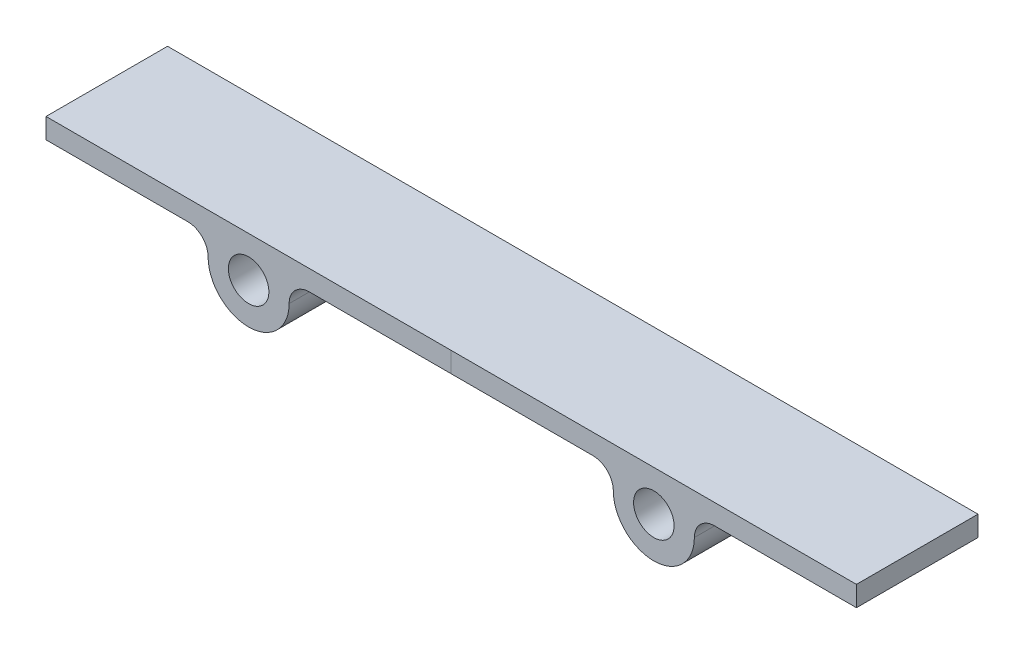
ISO-10303-21;
HEADER;
FILE_DESCRIPTION(('STEP AP214'),'2;1');
FILE_NAME('part.step','',(''),(''),'','','');
FILE_SCHEMA(('AUTOMOTIVE_DESIGN { 1 0 10303 214 1 1 1 1 }'));
ENDSEC;
DATA;
#1=APPLICATION_CONTEXT('core data for automotive mechanical design processes');
#2=APPLICATION_PROTOCOL_DEFINITION('international standard','automotive_design',2000,#1);
#3=PRODUCT_CONTEXT('',#1,'mechanical');
#4=PRODUCT('Part','Part','',(#3));
#5=PRODUCT_RELATED_PRODUCT_CATEGORY('part','',(#4));
#6=PRODUCT_DEFINITION_FORMATION('','',#4);
#7=PRODUCT_DEFINITION_CONTEXT('part definition',#1,'design');
#8=PRODUCT_DEFINITION('design','',#6,#7);
#9=PRODUCT_DEFINITION_SHAPE('','',#8);
#10=(LENGTH_UNIT() NAMED_UNIT(*) SI_UNIT(.MILLI.,.METRE.));
#11=(NAMED_UNIT(*) PLANE_ANGLE_UNIT() SI_UNIT($,.RADIAN.));
#12=(NAMED_UNIT(*) SI_UNIT($,.STERADIAN.) SOLID_ANGLE_UNIT());
#13=UNCERTAINTY_MEASURE_WITH_UNIT(LENGTH_MEASURE(1.E-05),#10,'distance_accuracy_value','');
#14=(GEOMETRIC_REPRESENTATION_CONTEXT(3) GLOBAL_UNCERTAINTY_ASSIGNED_CONTEXT((#13)) GLOBAL_UNIT_ASSIGNED_CONTEXT((#10,
#11,#12)) REPRESENTATION_CONTEXT('',''));
#15=CARTESIAN_POINT('',(0.,0.,0.));
#16=DIRECTION('',(0.,0.,1.));
#17=DIRECTION('',(1.,0.,0.));
#18=AXIS2_PLACEMENT_3D('',#15,#16,#17);
#19=CARTESIAN_POINT('',(-200.,-10.,30.));
#20=DIRECTION('',(0.,0.,1.));
#21=DIRECTION('',(1.,0.,0.));
#22=AXIS2_PLACEMENT_3D('',#19,#20,#21);
#23=PLANE('',#22);
#24=CARTESIAN_POINT('',(-100.,-20.,30.));
#25=DIRECTION('',(0.,0.,1.));
#26=DIRECTION('',(1.,0.,0.));
#27=AXIS2_PLACEMENT_3D('',#24,#25,#26);
#28=CIRCLE('',#27,10.);
#29=CARTESIAN_POINT('',(-90.,-20.,30.));
#30=VERTEX_POINT('',#29);
#31=EDGE_CURVE('E230',#30,#30,#28,.T.);
#32=ORIENTED_EDGE('',*,*,#31,.F.);
#33=EDGE_LOOP('',(#32));
#34=FACE_BOUND('',#33,.T.);
#35=DIRECTION('',(1.,0.,0.));
#36=VECTOR('',#35,1.);
#37=CARTESIAN_POINT('',(-200.,-10.,30.));
#38=LINE('',#37,#36);
#39=CARTESIAN_POINT('',(-70.,-10.,30.));
#40=VERTEX_POINT('',#39);
#41=CARTESIAN_POINT('',(0.,-10.,30.));
#42=VERTEX_POINT('',#41);
#43=EDGE_CURVE('E162',#40,#42,#38,.T.);
#44=ORIENTED_EDGE('',*,*,#43,.T.);
#45=DIRECTION('',(0.,1.,0.));
#46=VECTOR('',#45,1.);
#47=CARTESIAN_POINT('',(0.,-10.,30.));
#48=LINE('',#47,#46);
#49=CARTESIAN_POINT('',(0.,0.,30.));
#50=VERTEX_POINT('',#49);
#51=EDGE_CURVE('E11',#42,#50,#48,.T.);
#52=ORIENTED_EDGE('',*,*,#51,.T.);
#53=DIRECTION('',(1.,0.,0.));
#54=VECTOR('',#53,1.);
#55=CARTESIAN_POINT('',(-200.,0.,30.));
#56=LINE('',#55,#54);
#57=CARTESIAN_POINT('',(-200.,0.,30.));
#58=VERTEX_POINT('',#57);
#59=EDGE_CURVE('E146',#58,#50,#56,.T.);
#60=ORIENTED_EDGE('',*,*,#59,.F.);
#61=DIRECTION('',(0.,1.,0.));
#62=VECTOR('',#61,1.);
#63=CARTESIAN_POINT('',(-200.,-10.,30.));
#64=LINE('',#63,#62);
#65=CARTESIAN_POINT('',(-200.,-10.,30.));
#66=VERTEX_POINT('',#65);
#67=EDGE_CURVE('E141',#66,#58,#64,.T.);
#68=ORIENTED_EDGE('',*,*,#67,.F.);
#69=CARTESIAN_POINT('',(-130.,-10.,30.));
#70=VERTEX_POINT('',#69);
#71=EDGE_CURVE('E143',#66,#70,#38,.T.);
#72=ORIENTED_EDGE('',*,*,#71,.T.);
#73=CARTESIAN_POINT('',(-130.,-20.,30.));
#74=DIRECTION('',(0.,0.,1.));
#75=DIRECTION('',(1.,0.,0.));
#76=AXIS2_PLACEMENT_3D('',#73,#74,#75);
#77=CIRCLE('',#76,10.);
#78=CARTESIAN_POINT('',(-120.,-20.,30.));
#79=VERTEX_POINT('',#78);
#80=EDGE_CURVE('E253',#70,#79,#77,.F.);
#81=ORIENTED_EDGE('',*,*,#80,.T.);
#82=CARTESIAN_POINT('',(-100.,-20.,30.));
#83=DIRECTION('',(0.,0.,1.));
#84=DIRECTION('',(1.,0.,0.));
#85=AXIS2_PLACEMENT_3D('',#82,#83,#84);
#86=CIRCLE('',#85,20.);
#87=CARTESIAN_POINT('',(-100.,-40.,30.));
#88=VERTEX_POINT('',#87);
#89=EDGE_CURVE('E222',#79,#88,#86,.T.);
#90=ORIENTED_EDGE('',*,*,#89,.T.);
#91=CARTESIAN_POINT('',(-100.,-20.,30.));
#92=DIRECTION('',(0.,0.,1.));
#93=DIRECTION('',(1.,0.,0.));
#94=AXIS2_PLACEMENT_3D('',#91,#92,#93);
#95=CIRCLE('',#94,20.);
#96=CARTESIAN_POINT('',(-80.,-20.,30.));
#97=VERTEX_POINT('',#96);
#98=EDGE_CURVE('E249',#88,#97,#95,.T.);
#99=ORIENTED_EDGE('',*,*,#98,.T.);
#100=CARTESIAN_POINT('',(-70.,-20.,30.));
#101=DIRECTION('',(0.,0.,1.));
#102=DIRECTION('',(1.,0.,0.));
#103=AXIS2_PLACEMENT_3D('',#100,#101,#102);
#104=CIRCLE('',#103,10.);
#105=EDGE_CURVE('E264',#97,#40,#104,.F.);
#106=ORIENTED_EDGE('',*,*,#105,.T.);
#107=EDGE_LOOP('',(#44,#52,#60,#68,#72,#81,#90,#99,#106));
#108=FACE_BOUND('',#107,.T.);
#109=ADVANCED_FACE('F32',(#34,#108),#23,.T.);
#110=CARTESIAN_POINT('',(-200.,-10.,-30.));
#111=DIRECTION('',(0.,0.,-1.));
#112=DIRECTION('',(-1.,0.,0.));
#113=AXIS2_PLACEMENT_3D('',#110,#111,#112);
#114=PLANE('',#113);
#115=CARTESIAN_POINT('',(-100.,-20.,-30.));
#116=DIRECTION('',(0.,0.,-1.));
#117=DIRECTION('',(-1.,0.,0.));
#118=AXIS2_PLACEMENT_3D('',#115,#116,#117);
#119=CIRCLE('',#118,10.);
#120=CARTESIAN_POINT('',(-110.,-20.,-30.));
#121=VERTEX_POINT('',#120);
#122=EDGE_CURVE('E178',#121,#121,#119,.T.);
#123=ORIENTED_EDGE('',*,*,#122,.F.);
#124=EDGE_LOOP('',(#123));
#125=FACE_BOUND('',#124,.T.);
#126=DIRECTION('',(-1.,0.,0.));
#127=VECTOR('',#126,1.);
#128=CARTESIAN_POINT('',(-200.,0.,-30.));
#129=LINE('',#128,#127);
#130=CARTESIAN_POINT('',(0.,0.,-30.));
#131=VERTEX_POINT('',#130);
#132=CARTESIAN_POINT('',(-200.,0.,-30.));
#133=VERTEX_POINT('',#132);
#134=EDGE_CURVE('E174',#131,#133,#129,.T.);
#135=ORIENTED_EDGE('',*,*,#134,.F.);
#136=DIRECTION('',(0.,-1.,0.));
#137=VECTOR('',#136,1.);
#138=CARTESIAN_POINT('',(0.,-10.,-30.));
#139=LINE('',#138,#137);
#140=CARTESIAN_POINT('',(0.,-10.,-30.));
#141=VERTEX_POINT('',#140);
#142=EDGE_CURVE('E41',#131,#141,#139,.T.);
#143=ORIENTED_EDGE('',*,*,#142,.T.);
#144=DIRECTION('',(-1.,0.,0.));
#145=VECTOR('',#144,1.);
#146=CARTESIAN_POINT('',(-200.,-10.,-30.));
#147=LINE('',#146,#145);
#148=CARTESIAN_POINT('',(-70.,-10.,-30.));
#149=VERTEX_POINT('',#148);
#150=EDGE_CURVE('E203',#141,#149,#147,.T.);
#151=ORIENTED_EDGE('',*,*,#150,.T.);
#152=CARTESIAN_POINT('',(-70.,-20.,-30.));
#153=DIRECTION('',(0.,0.,-1.));
#154=DIRECTION('',(-1.,0.,0.));
#155=AXIS2_PLACEMENT_3D('',#152,#153,#154);
#156=CIRCLE('',#155,10.);
#157=CARTESIAN_POINT('',(-80.,-20.,-30.));
#158=VERTEX_POINT('',#157);
#159=EDGE_CURVE('E263',#149,#158,#156,.F.);
#160=ORIENTED_EDGE('',*,*,#159,.T.);
#161=CARTESIAN_POINT('',(-100.,-20.,-30.));
#162=DIRECTION('',(0.,0.,-1.));
#163=DIRECTION('',(-1.,0.,0.));
#164=AXIS2_PLACEMENT_3D('',#161,#162,#163);
#165=CIRCLE('',#164,20.);
#166=CARTESIAN_POINT('',(-100.,-40.,-30.));
#167=VERTEX_POINT('',#166);
#168=EDGE_CURVE('E241',#158,#167,#165,.T.);
#169=ORIENTED_EDGE('',*,*,#168,.T.);
#170=CARTESIAN_POINT('',(-100.,-20.,-30.));
#171=DIRECTION('',(0.,0.,-1.));
#172=DIRECTION('',(-1.,0.,0.));
#173=AXIS2_PLACEMENT_3D('',#170,#171,#172);
#174=CIRCLE('',#173,20.);
#175=CARTESIAN_POINT('',(-120.,-20.,-30.));
#176=VERTEX_POINT('',#175);
#177=EDGE_CURVE('E243',#167,#176,#174,.T.);
#178=ORIENTED_EDGE('',*,*,#177,.T.);
#179=CARTESIAN_POINT('',(-130.,-20.,-30.));
#180=DIRECTION('',(0.,0.,-1.));
#181=DIRECTION('',(-1.,0.,0.));
#182=AXIS2_PLACEMENT_3D('',#179,#180,#181);
#183=CIRCLE('',#182,10.);
#184=CARTESIAN_POINT('',(-130.,-10.,-30.));
#185=VERTEX_POINT('',#184);
#186=EDGE_CURVE('E271',#176,#185,#183,.F.);
#187=ORIENTED_EDGE('',*,*,#186,.T.);
#188=CARTESIAN_POINT('',(-200.,-10.,-30.));
#189=VERTEX_POINT('',#188);
#190=EDGE_CURVE('E212',#185,#189,#147,.T.);
#191=ORIENTED_EDGE('',*,*,#190,.T.);
#192=DIRECTION('',(0.,1.,0.));
#193=VECTOR('',#192,1.);
#194=CARTESIAN_POINT('',(-200.,-10.,-30.));
#195=LINE('',#194,#193);
#196=EDGE_CURVE('E167',#189,#133,#195,.T.);
#197=ORIENTED_EDGE('',*,*,#196,.T.);
#198=EDGE_LOOP('',(#135,#143,#151,#160,#169,#178,#187,#191,#197));
#199=FACE_BOUND('',#198,.T.);
#200=ADVANCED_FACE('F345',(#125,#199),#114,.T.);
#201=ORIENTED_EDGE('',*,*,#142,.F.);
#202=CARTESIAN_POINT('',(200.,0.,-30.));
#203=VERTEX_POINT('',#202);
#204=EDGE_CURVE('E169',#203,#131,#129,.T.);
#205=ORIENTED_EDGE('',*,*,#204,.F.);
#206=DIRECTION('',(0.,1.,0.));
#207=VECTOR('',#206,1.);
#208=CARTESIAN_POINT('',(200.,-10.,-30.));
#209=LINE('',#208,#207);
#210=CARTESIAN_POINT('',(200.,-10.,-30.));
#211=VERTEX_POINT('',#210);
#212=EDGE_CURVE('E220',#211,#203,#209,.T.);
#213=ORIENTED_EDGE('',*,*,#212,.F.);
#214=CARTESIAN_POINT('',(130.,-10.,-30.));
#215=VERTEX_POINT('',#214);
#216=EDGE_CURVE('E152',#211,#215,#147,.T.);
#217=ORIENTED_EDGE('',*,*,#216,.T.);
#218=CARTESIAN_POINT('',(130.,-20.,-30.));
#219=DIRECTION('',(0.,0.,-1.));
#220=DIRECTION('',(-1.,0.,0.));
#221=AXIS2_PLACEMENT_3D('',#218,#219,#220);
#222=CIRCLE('',#221,10.);
#223=CARTESIAN_POINT('',(120.,-20.,-30.));
#224=VERTEX_POINT('',#223);
#225=EDGE_CURVE('E290',#215,#224,#222,.F.);
#226=ORIENTED_EDGE('',*,*,#225,.T.);
#227=CARTESIAN_POINT('',(100.,-20.,-30.));
#228=DIRECTION('',(0.,0.,-1.));
#229=DIRECTION('',(-1.,0.,0.));
#230=AXIS2_PLACEMENT_3D('',#227,#228,#229);
#231=CIRCLE('',#230,20.);
#232=CARTESIAN_POINT('',(100.,-40.,-30.));
#233=VERTEX_POINT('',#232);
#234=EDGE_CURVE('E281',#224,#233,#231,.T.);
#235=ORIENTED_EDGE('',*,*,#234,.T.);
#236=CARTESIAN_POINT('',(100.,-20.,-30.));
#237=DIRECTION('',(0.,0.,-1.));
#238=DIRECTION('',(-1.,0.,0.));
#239=AXIS2_PLACEMENT_3D('',#236,#237,#238);
#240=CIRCLE('',#239,20.);
#241=CARTESIAN_POINT('',(80.,-20.,-30.));
#242=VERTEX_POINT('',#241);
#243=EDGE_CURVE('E283',#233,#242,#240,.T.);
#244=ORIENTED_EDGE('',*,*,#243,.T.);
#245=CARTESIAN_POINT('',(70.,-20.,-30.));
#246=DIRECTION('',(0.,0.,-1.));
#247=DIRECTION('',(-1.,0.,0.));
#248=AXIS2_PLACEMENT_3D('',#245,#246,#247);
#249=CIRCLE('',#248,10.);
#250=CARTESIAN_POINT('',(70.,-10.,-30.));
#251=VERTEX_POINT('',#250);
#252=EDGE_CURVE('E309',#242,#251,#249,.F.);
#253=ORIENTED_EDGE('',*,*,#252,.T.);
#254=EDGE_CURVE('E200',#251,#141,#147,.T.);
#255=ORIENTED_EDGE('',*,*,#254,.T.);
#256=EDGE_LOOP('',(#201,#205,#213,#217,#226,#235,#244,#253,#255));
#257=FACE_BOUND('',#256,.T.);
#258=CARTESIAN_POINT('',(100.,-20.,-30.));
#259=DIRECTION('',(0.,0.,1.));
#260=DIRECTION('',(1.,0.,0.));
#261=AXIS2_PLACEMENT_3D('',#258,#259,#260);
#262=CIRCLE('',#261,10.);
#263=CARTESIAN_POINT('',(110.,-20.,-30.));
#264=VERTEX_POINT('',#263);
#265=EDGE_CURVE('E328',#264,#264,#262,.T.);
#266=ORIENTED_EDGE('',*,*,#265,.T.);
#267=EDGE_LOOP('',(#266));
#268=FACE_BOUND('',#267,.T.);
#269=ADVANCED_FACE('F300',(#257,#268),#114,.T.);
#270=ORIENTED_EDGE('',*,*,#51,.F.);
#271=CARTESIAN_POINT('',(70.,-10.,30.));
#272=VERTEX_POINT('',#271);
#273=EDGE_CURVE('E171',#42,#272,#38,.T.);
#274=ORIENTED_EDGE('',*,*,#273,.T.);
#275=CARTESIAN_POINT('',(70.,-20.,30.));
#276=DIRECTION('',(0.,0.,1.));
#277=DIRECTION('',(1.,0.,0.));
#278=AXIS2_PLACEMENT_3D('',#275,#276,#277);
#279=CIRCLE('',#278,10.);
#280=CARTESIAN_POINT('',(80.,-20.,30.));
#281=VERTEX_POINT('',#280);
#282=EDGE_CURVE('E304',#272,#281,#279,.F.);
#283=ORIENTED_EDGE('',*,*,#282,.T.);
#284=CARTESIAN_POINT('',(100.,-20.,30.));
#285=DIRECTION('',(0.,0.,1.));
#286=DIRECTION('',(1.,0.,0.));
#287=AXIS2_PLACEMENT_3D('',#284,#285,#286);
#288=CIRCLE('',#287,20.);
#289=CARTESIAN_POINT('',(100.,-40.,30.));
#290=VERTEX_POINT('',#289);
#291=EDGE_CURVE('E279',#281,#290,#288,.T.);
#292=ORIENTED_EDGE('',*,*,#291,.T.);
#293=CARTESIAN_POINT('',(100.,-20.,30.));
#294=DIRECTION('',(0.,0.,1.));
#295=DIRECTION('',(1.,0.,0.));
#296=AXIS2_PLACEMENT_3D('',#293,#294,#295);
#297=CIRCLE('',#296,20.);
#298=CARTESIAN_POINT('',(120.,-20.,30.));
#299=VERTEX_POINT('',#298);
#300=EDGE_CURVE('E277',#290,#299,#297,.T.);
#301=ORIENTED_EDGE('',*,*,#300,.T.);
#302=CARTESIAN_POINT('',(130.,-20.,30.));
#303=DIRECTION('',(0.,0.,1.));
#304=DIRECTION('',(1.,0.,0.));
#305=AXIS2_PLACEMENT_3D('',#302,#303,#304);
#306=CIRCLE('',#305,10.);
#307=CARTESIAN_POINT('',(130.,-10.,30.));
#308=VERTEX_POINT('',#307);
#309=EDGE_CURVE('E291',#299,#308,#306,.F.);
#310=ORIENTED_EDGE('',*,*,#309,.T.);
#311=CARTESIAN_POINT('',(200.,-10.,30.));
#312=VERTEX_POINT('',#311);
#313=EDGE_CURVE('E168',#308,#312,#38,.T.);
#314=ORIENTED_EDGE('',*,*,#313,.T.);
#315=DIRECTION('',(0.,1.,0.));
#316=VECTOR('',#315,1.);
#317=CARTESIAN_POINT('',(200.,-10.,30.));
#318=LINE('',#317,#316);
#319=CARTESIAN_POINT('',(200.,0.,30.));
#320=VERTEX_POINT('',#319);
#321=EDGE_CURVE('E151',#312,#320,#318,.T.);
#322=ORIENTED_EDGE('',*,*,#321,.T.);
#323=EDGE_CURVE('E226',#50,#320,#56,.T.);
#324=ORIENTED_EDGE('',*,*,#323,.F.);
#325=EDGE_LOOP('',(#270,#274,#283,#292,#301,#310,#314,#322,#324));
#326=FACE_BOUND('',#325,.T.);
#327=CARTESIAN_POINT('',(100.,-20.,30.));
#328=DIRECTION('',(0.,0.,1.));
#329=DIRECTION('',(1.,0.,0.));
#330=AXIS2_PLACEMENT_3D('',#327,#328,#329);
#331=CIRCLE('',#330,10.);
#332=CARTESIAN_POINT('',(110.,-20.,30.));
#333=VERTEX_POINT('',#332);
#334=EDGE_CURVE('E325',#333,#333,#331,.T.);
#335=ORIENTED_EDGE('',*,*,#334,.F.);
#336=EDGE_LOOP('',(#335));
#337=FACE_BOUND('',#336,.T.);
#338=ADVANCED_FACE('F321',(#326,#337),#23,.T.);
#339=CARTESIAN_POINT('',(-200.,-10.,-30.));
#340=DIRECTION('',(0.,1.,0.));
#341=DIRECTION('',(0.,0.,1.));
#342=AXIS2_PLACEMENT_3D('',#339,#340,#341);
#343=PLANE('',#342);
#344=ORIENTED_EDGE('',*,*,#313,.F.);
#345=DIRECTION('',(0.,0.,-1.));
#346=VECTOR('',#345,1.);
#347=CARTESIAN_POINT('',(130.,-10.,-30.));
#348=LINE('',#347,#346);
#349=EDGE_CURVE('E195',#308,#215,#348,.T.);
#350=ORIENTED_EDGE('',*,*,#349,.T.);
#351=ORIENTED_EDGE('',*,*,#216,.F.);
#352=DIRECTION('',(0.,0.,-1.));
#353=VECTOR('',#352,1.);
#354=CARTESIAN_POINT('',(200.,-10.,-30.));
#355=LINE('',#354,#353);
#356=EDGE_CURVE('E161',#312,#211,#355,.T.);
#357=ORIENTED_EDGE('',*,*,#356,.F.);
#358=EDGE_LOOP('',(#344,#350,#351,#357));
#359=FACE_BOUND('',#358,.T.);
#360=ADVANCED_FACE('F357',(#359),#343,.F.);
#361=ORIENTED_EDGE('',*,*,#190,.F.);
#362=DIRECTION('',(0.,0.,-1.));
#363=VECTOR('',#362,1.);
#364=CARTESIAN_POINT('',(-130.,-10.,30.));
#365=LINE('',#364,#363);
#366=EDGE_CURVE('E160',#185,#70,#365,.F.);
#367=ORIENTED_EDGE('',*,*,#366,.T.);
#368=ORIENTED_EDGE('',*,*,#71,.F.);
#369=DIRECTION('',(0.,0.,1.));
#370=VECTOR('',#369,1.);
#371=CARTESIAN_POINT('',(-200.,-10.,-30.));
#372=LINE('',#371,#370);
#373=EDGE_CURVE('E158',#189,#66,#372,.T.);
#374=ORIENTED_EDGE('',*,*,#373,.F.);
#375=EDGE_LOOP('',(#361,#367,#368,#374));
#376=FACE_BOUND('',#375,.T.);
#377=ADVANCED_FACE('F157',(#376),#343,.F.);
#378=ORIENTED_EDGE('',*,*,#254,.F.);
#379=DIRECTION('',(0.,0.,1.));
#380=VECTOR('',#379,1.);
#381=CARTESIAN_POINT('',(70.,-10.,-30.));
#382=LINE('',#381,#380);
#383=EDGE_CURVE('E198',#251,#272,#382,.T.);
#384=ORIENTED_EDGE('',*,*,#383,.T.);
#385=ORIENTED_EDGE('',*,*,#273,.F.);
#386=ORIENTED_EDGE('',*,*,#43,.F.);
#387=DIRECTION('',(0.,0.,1.));
#388=VECTOR('',#387,1.);
#389=CARTESIAN_POINT('',(-70.,-10.,-30.));
#390=LINE('',#389,#388);
#391=EDGE_CURVE('E266',#40,#149,#390,.F.);
#392=ORIENTED_EDGE('',*,*,#391,.T.);
#393=ORIENTED_EDGE('',*,*,#150,.F.);
#394=EDGE_LOOP('',(#378,#384,#385,#386,#392,#393));
#395=FACE_BOUND('',#394,.T.);
#396=ADVANCED_FACE('F315',(#395),#343,.F.);
#397=CARTESIAN_POINT('',(-200.,-10.,-30.));
#398=DIRECTION('',(-1.,0.,0.));
#399=DIRECTION('',(0.,0.,1.));
#400=AXIS2_PLACEMENT_3D('',#397,#398,#399);
#401=PLANE('',#400);
#402=DIRECTION('',(0.,0.,1.));
#403=VECTOR('',#402,1.);
#404=CARTESIAN_POINT('',(-200.,0.,-30.));
#405=LINE('',#404,#403);
#406=EDGE_CURVE('E207',#133,#58,#405,.T.);
#407=ORIENTED_EDGE('',*,*,#406,.F.);
#408=ORIENTED_EDGE('',*,*,#196,.F.);
#409=ORIENTED_EDGE('',*,*,#373,.T.);
#410=ORIENTED_EDGE('',*,*,#67,.T.);
#411=EDGE_LOOP('',(#407,#408,#409,#410));
#412=FACE_BOUND('',#411,.T.);
#413=ADVANCED_FACE('F165',(#412),#401,.T.);
#414=CARTESIAN_POINT('',(200.,-10.,-30.));
#415=DIRECTION('',(1.,0.,0.));
#416=DIRECTION('',(0.,0.,-1.));
#417=AXIS2_PLACEMENT_3D('',#414,#415,#416);
#418=PLANE('',#417);
#419=DIRECTION('',(0.,0.,-1.));
#420=VECTOR('',#419,1.);
#421=CARTESIAN_POINT('',(200.,0.,-30.));
#422=LINE('',#421,#420);
#423=EDGE_CURVE('E224',#320,#203,#422,.T.);
#424=ORIENTED_EDGE('',*,*,#423,.F.);
#425=ORIENTED_EDGE('',*,*,#321,.F.);
#426=ORIENTED_EDGE('',*,*,#356,.T.);
#427=ORIENTED_EDGE('',*,*,#212,.T.);
#428=EDGE_LOOP('',(#424,#425,#426,#427));
#429=FACE_BOUND('',#428,.T.);
#430=ADVANCED_FACE('F368',(#429),#418,.T.);
#431=CARTESIAN_POINT('',(-200.,0.,-30.));
#432=DIRECTION('',(0.,1.,0.));
#433=DIRECTION('',(0.,0.,1.));
#434=AXIS2_PLACEMENT_3D('',#431,#432,#433);
#435=PLANE('',#434);
#436=ORIENTED_EDGE('',*,*,#406,.T.);
#437=ORIENTED_EDGE('',*,*,#59,.T.);
#438=ORIENTED_EDGE('',*,*,#323,.T.);
#439=ORIENTED_EDGE('',*,*,#423,.T.);
#440=ORIENTED_EDGE('',*,*,#204,.T.);
#441=ORIENTED_EDGE('',*,*,#134,.T.);
#442=EDGE_LOOP('',(#436,#437,#438,#439,#440,#441));
#443=FACE_BOUND('',#442,.T.);
#444=ADVANCED_FACE('F367',(#443),#435,.T.);
#445=CARTESIAN_POINT('',(-100.,-20.,30.));
#446=DIRECTION('',(0.,0.,-1.));
#447=DIRECTION('',(-1.,0.,0.));
#448=AXIS2_PLACEMENT_3D('',#445,#446,#447);
#449=CYLINDRICAL_SURFACE('',#448,20.);
#450=DIRECTION('',(0.,0.,-1.));
#451=VECTOR('',#450,1.);
#452=CARTESIAN_POINT('',(-120.,-20.,-30.));
#453=LINE('',#452,#451);
#454=EDGE_CURVE('E238',#176,#79,#453,.F.);
#455=ORIENTED_EDGE('',*,*,#454,.F.);
#456=ORIENTED_EDGE('',*,*,#177,.F.);
#457=DIRECTION('',(0.,0.,-1.));
#458=VECTOR('',#457,1.);
#459=CARTESIAN_POINT('',(-100.,-40.,30.));
#460=LINE('',#459,#458);
#461=EDGE_CURVE('E228',#88,#167,#460,.T.);
#462=ORIENTED_EDGE('',*,*,#461,.F.);
#463=ORIENTED_EDGE('',*,*,#89,.F.);
#464=EDGE_LOOP('',(#455,#456,#462,#463));
#465=FACE_BOUND('',#464,.T.);
#466=ADVANCED_FACE('F257',(#465),#449,.T.);
#467=CARTESIAN_POINT('',(-100.,-20.,30.));
#468=DIRECTION('',(0.,0.,1.));
#469=DIRECTION('',(1.,0.,0.));
#470=AXIS2_PLACEMENT_3D('',#467,#468,#469);
#471=CYLINDRICAL_SURFACE('',#470,20.);
#472=ORIENTED_EDGE('',*,*,#168,.F.);
#473=DIRECTION('',(0.,0.,1.));
#474=VECTOR('',#473,1.);
#475=CARTESIAN_POINT('',(-80.,-20.,-30.));
#476=LINE('',#475,#474);
#477=EDGE_CURVE('E246',#97,#158,#476,.F.);
#478=ORIENTED_EDGE('',*,*,#477,.F.);
#479=ORIENTED_EDGE('',*,*,#98,.F.);
#480=ORIENTED_EDGE('',*,*,#461,.T.);
#481=EDGE_LOOP('',(#472,#478,#479,#480));
#482=FACE_BOUND('',#481,.T.);
#483=ADVANCED_FACE('F258',(#482),#471,.T.);
#484=CARTESIAN_POINT('',(-100.,-20.,30.00005));
#485=DIRECTION('',(0.,0.,-1.));
#486=DIRECTION('',(-1.,0.,0.));
#487=AXIS2_PLACEMENT_3D('',#484,#485,#486);
#488=CYLINDRICAL_SURFACE('',#487,10.);
#489=ORIENTED_EDGE('',*,*,#31,.T.);
#490=EDGE_LOOP('',(#489));
#491=FACE_BOUND('',#490,.T.);
#492=ORIENTED_EDGE('',*,*,#122,.T.);
#493=EDGE_LOOP('',(#492));
#494=FACE_BOUND('',#493,.T.);
#495=ADVANCED_FACE('F386',(#491,#494),#488,.F.);
#496=CARTESIAN_POINT('',(-130.,-20.,-30.));
#497=DIRECTION('',(0.,0.,1.));
#498=DIRECTION('',(1.,0.,0.));
#499=AXIS2_PLACEMENT_3D('',#496,#497,#498);
#500=CYLINDRICAL_SURFACE('',#499,10.);
#501=ORIENTED_EDGE('',*,*,#80,.F.);
#502=ORIENTED_EDGE('',*,*,#366,.F.);
#503=ORIENTED_EDGE('',*,*,#186,.F.);
#504=ORIENTED_EDGE('',*,*,#454,.T.);
#505=EDGE_LOOP('',(#501,#502,#503,#504));
#506=FACE_BOUND('',#505,.T.);
#507=ADVANCED_FACE('F384',(#506),#500,.F.);
#508=CARTESIAN_POINT('',(-70.,-20.,-30.));
#509=DIRECTION('',(0.,0.,-1.));
#510=DIRECTION('',(-1.,0.,0.));
#511=AXIS2_PLACEMENT_3D('',#508,#509,#510);
#512=CYLINDRICAL_SURFACE('',#511,10.);
#513=ORIENTED_EDGE('',*,*,#159,.F.);
#514=ORIENTED_EDGE('',*,*,#391,.F.);
#515=ORIENTED_EDGE('',*,*,#105,.F.);
#516=ORIENTED_EDGE('',*,*,#477,.T.);
#517=EDGE_LOOP('',(#513,#514,#515,#516));
#518=FACE_BOUND('',#517,.T.);
#519=ADVANCED_FACE('F261',(#518),#512,.F.);
#520=CARTESIAN_POINT('',(100.,-20.,-30.));
#521=DIRECTION('',(0.,0.,1.));
#522=DIRECTION('',(1.,0.,0.));
#523=AXIS2_PLACEMENT_3D('',#520,#521,#522);
#524=CYLINDRICAL_SURFACE('',#523,20.);
#525=DIRECTION('',(0.,0.,-1.));
#526=VECTOR('',#525,1.);
#527=CARTESIAN_POINT('',(100.,-40.,30.));
#528=LINE('',#527,#526);
#529=EDGE_CURVE('E193',#233,#290,#528,.F.);
#530=ORIENTED_EDGE('',*,*,#529,.F.);
#531=ORIENTED_EDGE('',*,*,#234,.F.);
#532=DIRECTION('',(0.,0.,-1.));
#533=VECTOR('',#532,1.);
#534=CARTESIAN_POINT('',(120.,-20.,-30.));
#535=LINE('',#534,#533);
#536=EDGE_CURVE('E199',#299,#224,#535,.T.);
#537=ORIENTED_EDGE('',*,*,#536,.F.);
#538=ORIENTED_EDGE('',*,*,#300,.F.);
#539=EDGE_LOOP('',(#530,#531,#537,#538));
#540=FACE_BOUND('',#539,.T.);
#541=ADVANCED_FACE('F296',(#540),#524,.T.);
#542=CARTESIAN_POINT('',(100.,-20.,-30.));
#543=DIRECTION('',(0.,0.,-1.));
#544=DIRECTION('',(-1.,0.,0.));
#545=AXIS2_PLACEMENT_3D('',#542,#543,#544);
#546=CYLINDRICAL_SURFACE('',#545,20.);
#547=ORIENTED_EDGE('',*,*,#243,.F.);
#548=ORIENTED_EDGE('',*,*,#529,.T.);
#549=ORIENTED_EDGE('',*,*,#291,.F.);
#550=DIRECTION('',(0.,0.,1.));
#551=VECTOR('',#550,1.);
#552=CARTESIAN_POINT('',(80.,-20.,30.));
#553=LINE('',#552,#551);
#554=EDGE_CURVE('E269',#242,#281,#553,.T.);
#555=ORIENTED_EDGE('',*,*,#554,.F.);
#556=EDGE_LOOP('',(#547,#548,#549,#555));
#557=FACE_BOUND('',#556,.T.);
#558=ADVANCED_FACE('F324',(#557),#546,.T.);
#559=CARTESIAN_POINT('',(100.,-20.,30.));
#560=DIRECTION('',(0.,0.,-1.));
#561=DIRECTION('',(-1.,0.,0.));
#562=AXIS2_PLACEMENT_3D('',#559,#560,#561);
#563=CYLINDRICAL_SURFACE('',#562,10.);
#564=ORIENTED_EDGE('',*,*,#334,.T.);
#565=EDGE_LOOP('',(#564));
#566=FACE_BOUND('',#565,.T.);
#567=ORIENTED_EDGE('',*,*,#265,.F.);
#568=EDGE_LOOP('',(#567));
#569=FACE_BOUND('',#568,.T.);
#570=ADVANCED_FACE('F335',(#566,#569),#563,.F.);
#571=CARTESIAN_POINT('',(130.,-20.,-30.));
#572=DIRECTION('',(0.,0.,-1.));
#573=DIRECTION('',(-1.,0.,0.));
#574=AXIS2_PLACEMENT_3D('',#571,#572,#573);
#575=CYLINDRICAL_SURFACE('',#574,10.);
#576=ORIENTED_EDGE('',*,*,#309,.F.);
#577=ORIENTED_EDGE('',*,*,#536,.T.);
#578=ORIENTED_EDGE('',*,*,#225,.F.);
#579=ORIENTED_EDGE('',*,*,#349,.F.);
#580=EDGE_LOOP('',(#576,#577,#578,#579));
#581=FACE_BOUND('',#580,.T.);
#582=ADVANCED_FACE('F288',(#581),#575,.F.);
#583=CARTESIAN_POINT('',(70.,-20.,-30.));
#584=DIRECTION('',(0.,0.,1.));
#585=DIRECTION('',(1.,0.,0.));
#586=AXIS2_PLACEMENT_3D('',#583,#584,#585);
#587=CYLINDRICAL_SURFACE('',#586,10.);
#588=ORIENTED_EDGE('',*,*,#252,.F.);
#589=ORIENTED_EDGE('',*,*,#554,.T.);
#590=ORIENTED_EDGE('',*,*,#282,.F.);
#591=ORIENTED_EDGE('',*,*,#383,.F.);
#592=EDGE_LOOP('',(#588,#589,#590,#591));
#593=FACE_BOUND('',#592,.T.);
#594=ADVANCED_FACE('F34',(#593),#587,.F.);
#595=CLOSED_SHELL('',(#109,#200,#269,#338,#360,#377,#396,#413,#430,#444,#466,#483,#495,#507,
#519,#541,#558,#570,#582,#594));
#596=MANIFOLD_SOLID_BREP('B2',#595);
#597=ADVANCED_BREP_SHAPE_REPRESENTATION('',(#18,#596),#14);
#598=SHAPE_DEFINITION_REPRESENTATION(#9,#597);
ENDSEC;
END-ISO-10303-21;
